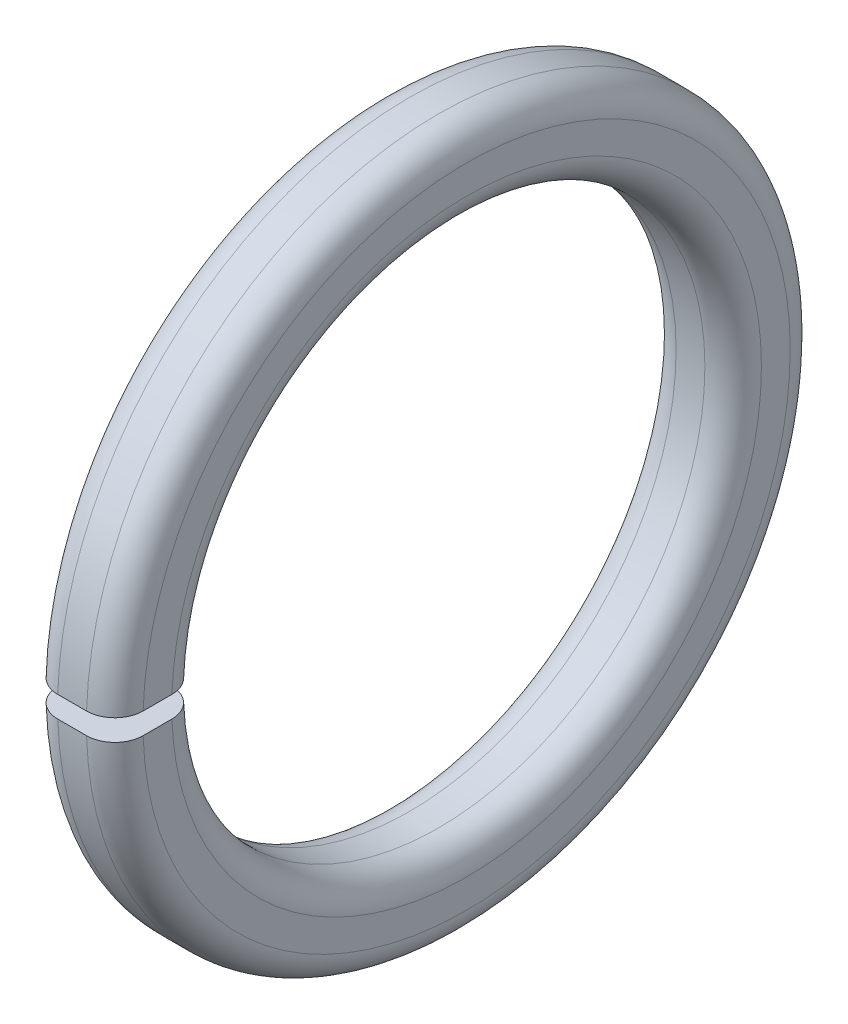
ISO-10303-21;
HEADER;
FILE_DESCRIPTION(('STEP AP214'),'2;1');
FILE_NAME('part.step','',(''),(''),'','','');
FILE_SCHEMA(('AUTOMOTIVE_DESIGN { 1 0 10303 214 1 1 1 1 }'));
ENDSEC;
DATA;
#1=APPLICATION_CONTEXT('core data for automotive mechanical design processes');
#2=APPLICATION_PROTOCOL_DEFINITION('international standard','automotive_design',2000,#1);
#3=PRODUCT_CONTEXT('',#1,'mechanical');
#4=PRODUCT('Part','Part','',(#3));
#5=PRODUCT_RELATED_PRODUCT_CATEGORY('part','',(#4));
#6=PRODUCT_DEFINITION_FORMATION('','',#4);
#7=PRODUCT_DEFINITION_CONTEXT('part definition',#1,'design');
#8=PRODUCT_DEFINITION('design','',#6,#7);
#9=PRODUCT_DEFINITION_SHAPE('','',#8);
#10=(LENGTH_UNIT() NAMED_UNIT(*) SI_UNIT(.MILLI.,.METRE.));
#11=(NAMED_UNIT(*) PLANE_ANGLE_UNIT() SI_UNIT($,.RADIAN.));
#12=(NAMED_UNIT(*) SI_UNIT($,.STERADIAN.) SOLID_ANGLE_UNIT());
#13=UNCERTAINTY_MEASURE_WITH_UNIT(LENGTH_MEASURE(1.E-05),#10,'distance_accuracy_value','');
#14=(GEOMETRIC_REPRESENTATION_CONTEXT(3) GLOBAL_UNCERTAINTY_ASSIGNED_CONTEXT((#13)) GLOBAL_UNIT_ASSIGNED_CONTEXT((#10,
#11,#12)) REPRESENTATION_CONTEXT('',''));
#15=CARTESIAN_POINT('',(0.,0.,0.));
#16=DIRECTION('',(0.,0.,1.));
#17=DIRECTION('',(1.,0.,0.));
#18=AXIS2_PLACEMENT_3D('',#15,#16,#17);
#19=CARTESIAN_POINT('',(-5.35,0.,0.));
#20=DIRECTION('',(-1.,0.,0.));
#21=DIRECTION('',(0.,0.,1.));
#22=AXIS2_PLACEMENT_3D('',#19,#20,#21);
#23=TOROIDAL_SURFACE('',#22,27.65,2.65);
#24=CARTESIAN_POINT('',(-5.35,0.,0.));
#25=DIRECTION('',(-1.,0.,0.));
#26=DIRECTION('',(0.,0.,1.));
#27=AXIS2_PLACEMENT_3D('',#24,#25,#26);
#28=CIRCLE('',#27,25.);
#29=CARTESIAN_POINT('',(-5.35,1.,24.9799919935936));
#30=VERTEX_POINT('',#29);
#31=CARTESIAN_POINT('',(-5.34999999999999,-1.,24.9799919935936));
#32=VERTEX_POINT('',#31);
#33=EDGE_CURVE('E129',#30,#32,#28,.T.);
#34=ORIENTED_EDGE('',*,*,#33,.F.);
#35=CARTESIAN_POINT('',(-6.96990723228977,1.,25.5331887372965));
#36=CARTESIAN_POINT('',(-7.08775296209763,1.,25.6242910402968));
#37=CARTESIAN_POINT('',(-7.19798718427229,1.,25.7254175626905));
#38=CARTESIAN_POINT('',(-7.39999939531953,1.,25.9448314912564));
#39=CARTESIAN_POINT('',(-7.49175482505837,1.,26.0631395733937));
#40=CARTESIAN_POINT('',(-7.65406230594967,1.,26.3134319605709));
#41=CARTESIAN_POINT('',(-7.72462504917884,1.,26.4454093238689));
#42=CARTESIAN_POINT('',(-7.84258219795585,1.,26.7192973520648));
#43=CARTESIAN_POINT('',(-7.88998236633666,1.,26.8612055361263));
#44=CARTESIAN_POINT('',(-7.96032408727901,1.,27.1510413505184));
#45=CARTESIAN_POINT('',(-7.98325249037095,1.,27.2989721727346));
#46=CARTESIAN_POINT('',(-8.00395499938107,1.,27.5965894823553));
#47=CARTESIAN_POINT('',(-8.00172806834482,1.,27.7462760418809));
#48=CARTESIAN_POINT('',(-7.97217620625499,1.,28.0431803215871));
#49=CARTESIAN_POINT('',(-7.94484643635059,1.,28.1903975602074));
#50=CARTESIAN_POINT('',(-7.8658537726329,1.,28.4781521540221));
#51=CARTESIAN_POINT('',(-7.81419094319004,1.,28.6186895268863));
#52=CARTESIAN_POINT('',(-7.68800789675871,1.,28.8890609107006));
#53=CARTESIAN_POINT('',(-7.61349268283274,1.,29.018897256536));
#54=CARTESIAN_POINT('',(-7.44371189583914,1.,29.2642084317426));
#55=CARTESIAN_POINT('',(-7.34844641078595,1.,29.3796833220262));
#56=CARTESIAN_POINT('',(-7.13992009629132,1.,29.5929308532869));
#57=CARTESIAN_POINT('',(-7.02666838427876,1.,29.6907124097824));
#58=CARTESIAN_POINT('',(-6.7853482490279,1.,29.8658615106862));
#59=CARTESIAN_POINT('',(-6.65727985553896,1.,29.9432290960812));
#60=CARTESIAN_POINT('',(-6.39003987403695,1.,30.0753083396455));
#61=CARTESIAN_POINT('',(-6.25087460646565,1.,30.1300327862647));
#62=CARTESIAN_POINT('',(-5.96532964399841,1.,30.2153300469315));
#63=CARTESIAN_POINT('',(-5.81894997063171,1.,30.2459029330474));
#64=CARTESIAN_POINT('',(-5.52319669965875,1.,30.2820184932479));
#65=CARTESIAN_POINT('',(-5.3738243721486,1.,30.2875715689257));
#66=CARTESIAN_POINT('',(-5.07626814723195,1.,30.2735177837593));
#67=CARTESIAN_POINT('',(-4.92808424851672,1.,30.2539109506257));
#68=CARTESIAN_POINT('',(-4.63713119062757,1.,30.1900999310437));
#69=CARTESIAN_POINT('',(-4.49436132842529,1.,30.1458989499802));
#70=CARTESIAN_POINT('',(-4.2182666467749,1.,30.0341598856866));
#71=CARTESIAN_POINT('',(-4.08494183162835,1.,29.9666217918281));
#72=CARTESIAN_POINT('',(-3.83149247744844,1.,29.8101139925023));
#73=CARTESIAN_POINT('',(-3.71137052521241,1.,29.7211400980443));
#74=CARTESIAN_POINT('',(-3.48776039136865,1.,29.5242969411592));
#75=CARTESIAN_POINT('',(-3.38427224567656,1.,29.4164276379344));
#76=CARTESIAN_POINT('',(-3.19681541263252,1.,29.1848035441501));
#77=CARTESIAN_POINT('',(-3.1128557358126,1.,29.0610414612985));
#78=CARTESIAN_POINT('',(-2.96689212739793,1.,28.801184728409));
#79=CARTESIAN_POINT('',(-2.90488826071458,1.,28.6650900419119));
#80=CARTESIAN_POINT('',(-2.80455922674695,1.,28.3843481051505));
#81=CARTESIAN_POINT('',(-2.7662476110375,1.,28.2396960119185));
#82=CARTESIAN_POINT('',(-2.71444060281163,1.,27.9460140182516));
#83=CARTESIAN_POINT('',(-2.700945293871,1.,27.7969841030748));
#84=CARTESIAN_POINT('',(-2.69915037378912,1.,27.4987030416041));
#85=CARTESIAN_POINT('',(-2.71086249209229,1.,27.3494518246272));
#86=CARTESIAN_POINT('',(-2.75917372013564,1.,27.0550330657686));
#87=CARTESIAN_POINT('',(-2.79577284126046,1.,26.909865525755));
#88=CARTESIAN_POINT('',(-2.89282880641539,1.,26.62771475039));
#89=CARTESIAN_POINT('',(-2.95328898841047,1.,26.4907326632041));
#90=CARTESIAN_POINT('',(-3.09635528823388,1.,26.2288669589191));
#91=CARTESIAN_POINT('',(-3.17896142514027,1.,26.1039833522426));
#92=CARTESIAN_POINT('',(-3.3639508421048,1.,25.869903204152));
#93=CARTESIAN_POINT('',(-3.46632809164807,1.,25.7607018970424));
#94=CARTESIAN_POINT('',(-3.68797384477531,1.,25.5610505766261));
#95=CARTESIAN_POINT('',(-3.80724232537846,1.,25.4706005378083));
#96=CARTESIAN_POINT('',(-4.0592032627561,1.,25.3110830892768));
#97=CARTESIAN_POINT('',(-4.1918870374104,1.,25.2420019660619));
#98=CARTESIAN_POINT('',(-4.46697000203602,1.,25.1271172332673));
#99=CARTESIAN_POINT('',(-4.60936876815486,1.,25.0813126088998));
#100=CARTESIAN_POINT('',(-4.89971814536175,1.,25.0143119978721));
#101=CARTESIAN_POINT('',(-5.04766409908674,1.,24.9930958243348));
#102=CARTESIAN_POINT('',(-5.34505817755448,1.,24.9758103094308));
#103=CARTESIAN_POINT('',(-5.49450666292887,1.,24.9797471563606));
#104=CARTESIAN_POINT('',(-5.79061945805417,1.,25.0126610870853));
#105=CARTESIAN_POINT('',(-5.93728351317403,1.,25.0416404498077));
#106=CARTESIAN_POINT('',(-6.22353576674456,1.,25.1238034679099));
#107=CARTESIAN_POINT('',(-6.36313227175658,1.,25.176957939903));
#108=CARTESIAN_POINT('',(-6.58082324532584,1.,25.2815707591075));
#109=CARTESIAN_POINT('',(-6.66229940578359,1.,25.3261455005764));
#110=CARTESIAN_POINT('',(-6.82013727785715,1.,25.4235798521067));
#111=CARTESIAN_POINT('',(-6.89649899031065,1.,25.476439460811));
#112=CARTESIAN_POINT('',(-6.96990723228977,1.,25.5331887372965));
#113=B_SPLINE_CURVE_WITH_KNOTS('',3,(#35,#36,#37,#38,#39,#40,#41,#42,#43,#44,#45,#46,#47,#48,
#49,#50,#51,#52,#53,#54,#55,#56,#57,#58,#59,#60,#61,#62,#63,#64,#65,#66,#67,#68,#69,#70,#71,#72,
#73,#74,#75,#76,#77,#78,#79,#80,#81,#82,#83,#84,#85,#86,#87,#88,#89,#90,#91,#92,#93,#94,#95,#96,
#97,#98,#99,#100,#101,#102,#103,#104,#105,#106,#107,#108,#109,#110,#111,#112),.UNSPECIFIED.,.T.,
.F.,(4,2,2,2,2,2,2,2,2,2,2,2,2,2,2,2,2,2,2,2,2,2,2,2,2,2,2,2,2,2,2,2,2,2,2,2,2,2,4),(0.,
0.446522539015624,0.893586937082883,1.34042540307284,1.78715263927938,2.23411979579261,
2.68110537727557,3.12817713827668,3.57524771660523,4.02222048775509,4.46919136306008,
4.91593638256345,5.36268050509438,5.80917196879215,6.25566210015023,6.70196659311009,
7.14827059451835,7.59451644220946,8.04076249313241,8.48709582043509,8.93343011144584,
9.37996993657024,9.82651108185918,10.2733074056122,10.7201052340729,11.1671110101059,
11.6141169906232,12.0611855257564,12.5082544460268,12.9551872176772,13.4021193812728,
13.8487641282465,14.2953894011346,14.7416477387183,15.1880158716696,15.6344246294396,
16.0802959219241,16.3584429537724,16.6365899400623),.UNSPECIFIED.);
#114=CARTESIAN_POINT('',(-8.,1.,27.6319109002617));
#115=VERTEX_POINT('',#114);
#116=EDGE_CURVE('E53',#30,#115,#113,.T.);
#117=ORIENTED_EDGE('',*,*,#116,.T.);
#118=CARTESIAN_POINT('',(-8.,0.,0.));
#119=DIRECTION('',(-1.,0.,0.));
#120=DIRECTION('',(0.,0.,1.));
#121=AXIS2_PLACEMENT_3D('',#118,#119,#120);
#122=CIRCLE('',#121,27.65);
#123=CARTESIAN_POINT('',(-8.,-1.,27.6319109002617));
#124=VERTEX_POINT('',#123);
#125=EDGE_CURVE('E141',#115,#124,#122,.T.);
#126=ORIENTED_EDGE('',*,*,#125,.T.);
#127=CARTESIAN_POINT('',(-6.96990723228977,-1.,25.5331887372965));
#128=CARTESIAN_POINT('',(-6.85217775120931,-1.,25.4421929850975));
#129=CARTESIAN_POINT('',(-6.72668223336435,-1.,25.3610683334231));
#130=CARTESIAN_POINT('',(-6.46374833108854,-1.,25.220972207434));
#131=CARTESIAN_POINT('',(-6.32629585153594,-1.,25.1620273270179));
#132=CARTESIAN_POINT('',(-6.04349278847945,-1.,25.0680816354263));
#133=CARTESIAN_POINT('',(-5.89814580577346,-1.,25.0330700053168));
#134=CARTESIAN_POINT('',(-5.60367564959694,-1.,24.9879664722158));
#135=CARTESIAN_POINT('',(-5.45455342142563,-1.,24.9778683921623));
#136=CARTESIAN_POINT('',(-5.15676828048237,-1.,24.982858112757));
#137=CARTESIAN_POINT('',(-5.00810526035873,-1.,24.9979394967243));
#138=CARTESIAN_POINT('',(-4.7154159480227,-1.,25.0528474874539));
#139=CARTESIAN_POINT('',(-4.57138983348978,-1.,25.0926750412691));
#140=CARTESIAN_POINT('',(-4.29206798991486,-1.,25.1959394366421));
#141=CARTESIAN_POINT('',(-4.15677216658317,-1.,25.2593760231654));
#142=CARTESIAN_POINT('',(-3.8987435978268,-1.,25.4080514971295));
#143=CARTESIAN_POINT('',(-3.77601085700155,-1.,25.4932903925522));
#144=CARTESIAN_POINT('',(-3.54652145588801,-1.,25.6831964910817));
#145=CARTESIAN_POINT('',(-3.43977321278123,-1.,25.7878738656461));
#146=CARTESIAN_POINT('',(-3.24534991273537,-1.,26.0136524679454));
#147=CARTESIAN_POINT('',(-3.15767489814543,-1.,26.1347537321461));
#148=CARTESIAN_POINT('',(-3.00381829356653,-1.,26.3900390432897));
#149=CARTESIAN_POINT('',(-2.93765268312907,-1.,26.5242327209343));
#150=CARTESIAN_POINT('',(-2.8287747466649,-1.,26.8018193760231));
#151=CARTESIAN_POINT('',(-2.7860625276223,-1.,26.9452123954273));
#152=CARTESIAN_POINT('',(-2.72528173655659,-1.,27.2372159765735));
#153=CARTESIAN_POINT('',(-2.70722736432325,-1.,27.3858294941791));
#154=CARTESIAN_POINT('',(-2.69632023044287,-1.,27.6839785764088));
#155=CARTESIAN_POINT('',(-2.70346749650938,-1.,27.8335141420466));
#156=CARTESIAN_POINT('',(-2.7427665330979,-1.,28.1292884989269));
#157=CARTESIAN_POINT('',(-2.77492249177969,-1.,28.2755267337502));
#158=CARTESIAN_POINT('',(-2.86333556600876,-1.,28.5605267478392));
#159=CARTESIAN_POINT('',(-2.91959266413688,-1.,28.6992885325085));
#160=CARTESIAN_POINT('',(-3.05459827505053,-1.,28.9653569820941));
#161=CARTESIAN_POINT('',(-3.13334100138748,-1.,29.092666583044));
#162=CARTESIAN_POINT('',(-3.31109278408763,-1.,29.3322499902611));
#163=CARTESIAN_POINT('',(-3.41010178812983,-1.,29.4445238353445));
#164=CARTESIAN_POINT('',(-3.62552082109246,-1.,29.6507855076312));
#165=CARTESIAN_POINT('',(-3.74192174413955,-1.,29.7447828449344));
#166=CARTESIAN_POINT('',(-3.98885965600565,-1.,29.911888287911));
#167=CARTESIAN_POINT('',(-4.11939660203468,-1.,29.9849964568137));
#168=CARTESIAN_POINT('',(-4.39082246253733,-1.,30.1082059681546));
#169=CARTESIAN_POINT('',(-4.53170554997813,-1.,30.1583201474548));
#170=CARTESIAN_POINT('',(-4.81988733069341,-1.,30.2341744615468));
#171=CARTESIAN_POINT('',(-4.96718600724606,-1.,30.2599146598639));
#172=CARTESIAN_POINT('',(-5.26395564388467,-1.,30.286282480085));
#173=CARTESIAN_POINT('',(-5.41342572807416,-1.,30.2869199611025));
#174=CARTESIAN_POINT('',(-5.7103508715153,-1.,30.2630891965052));
#175=CARTESIAN_POINT('',(-5.85780593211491,-1.,30.2386209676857));
#176=CARTESIAN_POINT('',(-6.14650060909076,-1.,30.1652791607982));
#177=CARTESIAN_POINT('',(-6.28774083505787,-1.,30.1164079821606));
#178=CARTESIAN_POINT('',(-6.56001428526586,-1.,29.9956523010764));
#179=CARTESIAN_POINT('',(-6.69104751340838,-1.,29.9237678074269));
#180=CARTESIAN_POINT('',(-6.93922065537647,-1.,29.759011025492));
#181=CARTESIAN_POINT('',(-7.05635743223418,-1.,29.6661340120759));
#182=CARTESIAN_POINT('',(-7.27338517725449,-1.,29.4620410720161));
#183=CARTESIAN_POINT('',(-7.37327607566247,-1.,29.3508250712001));
#184=CARTESIAN_POINT('',(-7.55302818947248,-1.,29.1131553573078));
#185=CARTESIAN_POINT('',(-7.63287981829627,-1.,28.986694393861));
#186=CARTESIAN_POINT('',(-7.77023291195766,-1.,28.7221671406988));
#187=CARTESIAN_POINT('',(-7.82773426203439,-1.,28.5841007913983));
#188=CARTESIAN_POINT('',(-7.91878934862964,-1.,28.3001951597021));
#189=CARTESIAN_POINT('',(-7.9523289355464,-1.,28.1543513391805));
#190=CARTESIAN_POINT('',(-7.99445742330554,-1.,27.8591091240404));
#191=CARTESIAN_POINT('',(-8.00304723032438,-1.,27.7097108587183));
#192=CARTESIAN_POINT('',(-7.99503738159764,-1.,27.4115412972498));
#193=CARTESIAN_POINT('',(-7.97842921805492,-1.,27.2627702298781));
#194=CARTESIAN_POINT('',(-7.92046763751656,-1.,26.9700869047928));
#195=CARTESIAN_POINT('',(-7.87910804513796,-1.,26.8261758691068));
#196=CARTESIAN_POINT('',(-7.77279275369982,-1.,26.5472708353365));
#197=CARTESIAN_POINT('',(-7.70782345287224,-1.,26.4122820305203));
#198=CARTESIAN_POINT('',(-7.5561727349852,-1.,26.1552580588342));
#199=CARTESIAN_POINT('',(-7.46951753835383,-1.,26.0332075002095));
#200=CARTESIAN_POINT('',(-7.31310425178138,-1.,25.8481270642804));
#201=CARTESIAN_POINT('',(-7.24915594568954,-1.,25.7801010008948));
#202=CARTESIAN_POINT('',(-7.11445810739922,-1.,25.6511531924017));
#203=CARTESIAN_POINT('',(-7.04370857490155,-1.,25.5902314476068));
#204=CARTESIAN_POINT('',(-6.96990723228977,-1.,25.5331887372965));
#205=B_SPLINE_CURVE_WITH_KNOTS('',3,(#127,#128,#129,#130,#131,#132,#133,#134,#135,#136,#137,
#138,#139,#140,#141,#142,#143,#144,#145,#146,#147,#148,#149,#150,#151,#152,#153,#154,#155,#156,
#157,#158,#159,#160,#161,#162,#163,#164,#165,#166,#167,#168,#169,#170,#171,#172,#173,#174,#175,
#176,#177,#178,#179,#180,#181,#182,#183,#184,#185,#186,#187,#188,#189,#190,#191,#192,#193,#194,
#195,#196,#197,#198,#199,#200,#201,#202,#203,#204),.UNSPECIFIED.,.T.,.F.,(4,2,2,2,2,2,2,2,2,2,2,
2,2,2,2,2,2,2,2,2,2,2,2,2,2,2,2,2,2,2,2,2,2,2,2,2,2,2,4),(0.,0.446049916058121,
0.892632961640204,1.33901399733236,1.78528434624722,2.23144098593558,2.67761470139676,
3.1237835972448,3.56995265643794,4.01635584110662,4.4627600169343,4.90949507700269,
5.35623217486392,5.80322642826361,6.25022117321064,6.6972907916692,7.14436008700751,
7.59131443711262,8.03826763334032,8.48498763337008,8.93170628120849,9.37817523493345,
9.8246430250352,10.270935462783,10.717227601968,11.1634758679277,11.6097239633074,
12.0560726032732,12.5024230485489,12.9489866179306,13.39555248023,13.8423818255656,
14.2891949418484,14.7361589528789,15.1832345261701,15.6305680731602,16.0773633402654,
16.3569796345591,16.6365959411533),.UNSPECIFIED.);
#206=EDGE_CURVE('E120',#124,#32,#205,.T.);
#207=ORIENTED_EDGE('',*,*,#206,.T.);
#208=EDGE_LOOP('',(#34,#117,#126,#207));
#209=FACE_BOUND('',#208,.T.);
#210=ADVANCED_FACE('F39',(#209),#23,.T.);
#211=CARTESIAN_POINT('',(-8.,30.35,0.));
#212=DIRECTION('',(1.,0.,0.));
#213=DIRECTION('',(0.,0.,-1.));
#214=AXIS2_PLACEMENT_3D('',#211,#212,#213);
#215=PLANE('',#214);
#216=DIRECTION('',(0.,0.,-1.));
#217=VECTOR('',#216,1.);
#218=CARTESIAN_POINT('',(-8.,1.,33.66));
#219=LINE('',#218,#217);
#220=CARTESIAN_POINT('',(-8.,1.,30.3335210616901));
#221=VERTEX_POINT('',#220);
#222=EDGE_CURVE('E109',#221,#115,#219,.T.);
#223=ORIENTED_EDGE('',*,*,#222,.F.);
#224=CARTESIAN_POINT('',(-8.,0.,0.));
#225=DIRECTION('',(-1.,0.,0.));
#226=DIRECTION('',(0.,0.,1.));
#227=AXIS2_PLACEMENT_3D('',#224,#225,#226);
#228=CIRCLE('',#227,30.35);
#229=CARTESIAN_POINT('',(-8.,-1.,30.3335210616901));
#230=VERTEX_POINT('',#229);
#231=EDGE_CURVE('E138',#221,#230,#228,.T.);
#232=ORIENTED_EDGE('',*,*,#231,.T.);
#233=DIRECTION('',(0.,0.,1.));
#234=VECTOR('',#233,1.);
#235=CARTESIAN_POINT('',(-8.,-1.,0.));
#236=LINE('',#235,#234);
#237=EDGE_CURVE('E121',#124,#230,#236,.T.);
#238=ORIENTED_EDGE('',*,*,#237,.F.);
#239=ORIENTED_EDGE('',*,*,#125,.F.);
#240=EDGE_LOOP('',(#223,#232,#238,#239));
#241=FACE_BOUND('',#240,.T.);
#242=ADVANCED_FACE('F214',(#241),#215,.F.);
#243=CARTESIAN_POINT('',(-5.35,0.,0.));
#244=DIRECTION('',(-1.,0.,0.));
#245=DIRECTION('',(0.,0.,1.));
#246=AXIS2_PLACEMENT_3D('',#243,#244,#245);
#247=TOROIDAL_SURFACE('',#246,30.35,2.65);
#248=CARTESIAN_POINT('',(-5.7802442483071,1.,27.7171261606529));
#249=CARTESIAN_POINT('',(-5.63345465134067,1.,27.6929644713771));
#250=CARTESIAN_POINT('',(-5.48451768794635,1.,27.6811817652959));
#251=CARTESIAN_POINT('',(-5.18665609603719,1.,27.6827838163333));
#252=CARTESIAN_POINT('',(-5.03773169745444,1.,27.696198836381));
#253=CARTESIAN_POINT('',(-4.74430892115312,1.,27.7478410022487));
#254=CARTESIAN_POINT('',(-4.59980843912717,1.,27.7860561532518));
#255=CARTESIAN_POINT('',(-4.31931281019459,1.,27.8861904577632));
#256=CARTESIAN_POINT('',(-4.183315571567,1.,27.9481037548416));
#257=CARTESIAN_POINT('',(-3.92360109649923,1.,28.0938917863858));
#258=CARTESIAN_POINT('',(-3.79988725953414,1.,28.1777725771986));
#259=CARTESIAN_POINT('',(-3.56828342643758,1.,28.3651061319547));
#260=CARTESIAN_POINT('',(-3.4603940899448,1.,28.4685597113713));
#261=CARTESIAN_POINT('',(-3.26344556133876,1.,28.6921575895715));
#262=CARTESIAN_POINT('',(-3.17439634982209,1.,28.8123106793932));
#263=CARTESIAN_POINT('',(-3.01772010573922,1.,29.0658542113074));
#264=CARTESIAN_POINT('',(-2.95009310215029,1.,29.1992446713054));
#265=CARTESIAN_POINT('',(-2.83814074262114,1.,29.4755604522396));
#266=CARTESIAN_POINT('',(-2.79382900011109,1.,29.6184912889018));
#267=CARTESIAN_POINT('',(-2.7298213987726,1.,29.9097621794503));
#268=CARTESIAN_POINT('',(-2.71012555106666,1.,30.0581022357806));
#269=CARTESIAN_POINT('',(-2.69590536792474,1.,30.3560345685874));
#270=CARTESIAN_POINT('',(-2.70138955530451,1.,30.5056272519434));
#271=CARTESIAN_POINT('',(-2.73739506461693,1.,30.8017688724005));
#272=CARTESIAN_POINT('',(-2.76791642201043,1.,30.9483178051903));
#273=CARTESIAN_POINT('',(-2.85313226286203,1.,31.2342064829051));
#274=CARTESIAN_POINT('',(-2.9078261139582,1.,31.3735464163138));
#275=CARTESIAN_POINT('',(-3.03983827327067,1.,31.6410617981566));
#276=CARTESIAN_POINT('',(-3.11715653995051,1.,31.7692372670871));
#277=CARTESIAN_POINT('',(-3.29219655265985,1.,32.0107385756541));
#278=CARTESIAN_POINT('',(-3.38991149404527,1.,32.1240693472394));
#279=CARTESIAN_POINT('',(-3.60298922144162,1.,32.3327077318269));
#280=CARTESIAN_POINT('',(-3.71835196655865,1.,32.4280153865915));
#281=CARTESIAN_POINT('',(-3.96339193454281,1.,32.5978540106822));
#282=CARTESIAN_POINT('',(-4.09306234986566,1.,32.6723948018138));
#283=CARTESIAN_POINT('',(-4.36308099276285,1.,32.7986378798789));
#284=CARTESIAN_POINT('',(-4.50342919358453,1.,32.8503402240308));
#285=CARTESIAN_POINT('',(-4.79075533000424,1.,32.929417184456));
#286=CARTESIAN_POINT('',(-4.93773042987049,1.,32.9568021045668));
#287=CARTESIAN_POINT('',(-5.2341921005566,1.,32.9865020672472));
#288=CARTESIAN_POINT('',(-5.38367866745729,1.,32.9888171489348));
#289=CARTESIAN_POINT('',(-5.6808841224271,1.,32.9683139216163));
#290=CARTESIAN_POINT('',(-5.82860340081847,1.,32.9455012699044));
#291=CARTESIAN_POINT('',(-6.11811555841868,1.,32.8754008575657));
#292=CARTESIAN_POINT('',(-6.25990843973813,1.,32.8281131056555));
#293=CARTESIAN_POINT('',(-6.533550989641,1.,32.7104049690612));
#294=CARTESIAN_POINT('',(-6.66540019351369,1.,32.639983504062));
#295=CARTESIAN_POINT('',(-6.91540922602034,1.,32.4780108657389));
#296=CARTESIAN_POINT('',(-7.03356903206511,1.,32.3864596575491));
#297=CARTESIAN_POINT('',(-7.25288465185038,1.,32.1847979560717));
#298=CARTESIAN_POINT('',(-7.35403528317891,1.,32.0746818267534));
#299=CARTESIAN_POINT('',(-7.53642401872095,1.,31.8390376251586));
#300=CARTESIAN_POINT('',(-7.61766209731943,1.,31.7135095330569));
#301=CARTESIAN_POINT('',(-7.75795980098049,1.,31.45054310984));
#302=CARTESIAN_POINT('',(-7.81700921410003,1.,31.3130993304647));
#303=CARTESIAN_POINT('',(-7.91120690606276,1.,31.0302516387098));
#304=CARTESIAN_POINT('',(-7.94635507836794,1.,30.8848476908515));
#305=CARTESIAN_POINT('',(-7.99176736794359,1.,30.5901378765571));
#306=CARTESIAN_POINT('',(-8.00202036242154,1.,30.4408302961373));
#307=CARTESIAN_POINT('',(-7.99732097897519,1.,30.142611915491));
#308=CARTESIAN_POINT('',(-7.98236850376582,1.,29.9937011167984));
#309=CARTESIAN_POINT('',(-7.92767486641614,1.,29.7004626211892));
#310=CARTESIAN_POINT('',(-7.88792714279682,1.,29.556136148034));
#311=CARTESIAN_POINT('',(-7.78476461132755,1.,29.2762112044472));
#312=CARTESIAN_POINT('',(-7.72135072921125,1.,29.1406123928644));
#313=CARTESIAN_POINT('',(-7.57266837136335,1.,28.8820156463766));
#314=CARTESIAN_POINT('',(-7.48740430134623,1.,28.759015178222));
#315=CARTESIAN_POINT('',(-7.29740243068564,1.,28.5290508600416));
#316=CARTESIAN_POINT('',(-7.19265983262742,1.,28.4220909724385));
#317=CARTESIAN_POINT('',(-6.9667016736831,1.,28.2272922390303));
#318=CARTESIAN_POINT('',(-6.84548552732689,1.,28.1394540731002));
#319=CARTESIAN_POINT('',(-6.59011080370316,1.,27.9854827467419));
#320=CARTESIAN_POINT('',(-6.45596802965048,1.,27.9193235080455));
#321=CARTESIAN_POINT('',(-6.23071607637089,1.,27.8309371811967));
#322=CARTESIAN_POINT('',(-6.14234888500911,1.,27.8015407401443));
#323=CARTESIAN_POINT('',(-5.96301586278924,1.,27.7521908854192));
#324=CARTESIAN_POINT('',(-5.87205003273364,1.,27.7322374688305));
#325=CARTESIAN_POINT('',(-5.7802442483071,1.,27.7171261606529));
#326=B_SPLINE_CURVE_WITH_KNOTS('',3,(#248,#249,#250,#251,#252,#253,#254,#255,#256,#257,#258,
#259,#260,#261,#262,#263,#264,#265,#266,#267,#268,#269,#270,#271,#272,#273,#274,#275,#276,#277,
#278,#279,#280,#281,#282,#283,#284,#285,#286,#287,#288,#289,#290,#291,#292,#293,#294,#295,#296,
#297,#298,#299,#300,#301,#302,#303,#304,#305,#306,#307,#308,#309,#310,#311,#312,#313,#314,#315,
#316,#317,#318,#319,#320,#321,#322,#323,#324,#325),.UNSPECIFIED.,.T.,.F.,(4,2,2,2,2,2,2,2,2,2,2,
2,2,2,2,2,2,2,2,2,2,2,2,2,2,2,2,2,2,2,2,2,2,2,2,2,2,2,4),(0.,0.445954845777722,
0.892445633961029,1.33872063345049,1.78488541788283,2.23117333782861,2.677479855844,
3.1240222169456,3.57056518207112,4.01736858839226,4.46417219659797,4.91112704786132,
5.35808253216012,5.80502632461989,6.25196929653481,6.69876339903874,7.14555646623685,
7.59213785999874,8.03871813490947,8.48510909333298,8.93149935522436,9.37778913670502,
9.82407875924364,10.2703892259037,10.71670042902,11.1631473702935,11.6095948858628,
12.0562476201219,12.5029023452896,12.9497565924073,13.3966125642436,13.8435868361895,
14.2905436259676,14.7374103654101,15.184387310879,15.63138014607,16.0778332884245,
16.3567443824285,16.6356553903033),.UNSPECIFIED.);
#327=CARTESIAN_POINT('',(-5.35,1.,32.9848450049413));
#328=VERTEX_POINT('',#327);
#329=EDGE_CURVE('E152',#328,#221,#326,.T.);
#330=ORIENTED_EDGE('',*,*,#329,.F.);
#331=CARTESIAN_POINT('',(-5.35,0.,0.));
#332=DIRECTION('',(-1.,0.,0.));
#333=DIRECTION('',(0.,0.,1.));
#334=AXIS2_PLACEMENT_3D('',#331,#332,#333);
#335=CIRCLE('',#334,33.);
#336=CARTESIAN_POINT('',(-5.35,-1.,32.9848450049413));
#337=VERTEX_POINT('',#336);
#338=EDGE_CURVE('E135',#328,#337,#335,.T.);
#339=ORIENTED_EDGE('',*,*,#338,.T.);
#340=CARTESIAN_POINT('',(-5.7802442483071,-1.,27.7171261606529));
#341=CARTESIAN_POINT('',(-5.9270773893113,-1.,27.7413084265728));
#342=CARTESIAN_POINT('',(-6.07197486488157,-1.,27.7779124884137));
#343=CARTESIAN_POINT('',(-6.35368560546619,-1.,27.8749649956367));
#344=CARTESIAN_POINT('',(-6.49048889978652,-1.,27.9354421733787));
#345=CARTESIAN_POINT('',(-6.7519428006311,-1.,28.0784830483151));
#346=CARTESIAN_POINT('',(-6.87659943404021,-1.,28.1610357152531));
#347=CARTESIAN_POINT('',(-7.11025577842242,-1.,28.3458678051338));
#348=CARTESIAN_POINT('',(-7.21925935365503,-1.,28.4481423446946));
#349=CARTESIAN_POINT('',(-7.41861742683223,-1.,28.6695826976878));
#350=CARTESIAN_POINT('',(-7.50896250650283,-1.,28.7887569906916));
#351=CARTESIAN_POINT('',(-7.66837989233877,-1.,29.0405790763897));
#352=CARTESIAN_POINT('',(-7.73745129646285,-1.,29.1732274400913));
#353=CARTESIAN_POINT('',(-7.85239618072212,-1.,29.4483092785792));
#354=CARTESIAN_POINT('',(-7.89825649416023,-1.,29.5907482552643));
#355=CARTESIAN_POINT('',(-7.96542207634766,-1.,29.8813022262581));
#356=CARTESIAN_POINT('',(-7.98672733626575,-1.,30.0294172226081));
#357=CARTESIAN_POINT('',(-8.00418239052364,-1.,30.3271745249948));
#358=CARTESIAN_POINT('',(-8.00032335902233,-1.,30.4768173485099));
#359=CARTESIAN_POINT('',(-7.96753699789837,-1.,30.7733310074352));
#360=CARTESIAN_POINT('',(-7.93860970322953,-1.,30.9202018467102));
#361=CARTESIAN_POINT('',(-7.85650518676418,-1.,31.2069993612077));
#362=CARTESIAN_POINT('',(-7.80332829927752,-1.,31.3469261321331));
#363=CARTESIAN_POINT('',(-7.67423006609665,-1.,31.6158619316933));
#364=CARTESIAN_POINT('',(-7.59830872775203,-1.,31.7448709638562));
#365=CARTESIAN_POINT('',(-7.42590180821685,-1.,31.9882629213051));
#366=CARTESIAN_POINT('',(-7.32942293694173,-1.,32.1026505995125));
#367=CARTESIAN_POINT('',(-7.11862233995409,-1.,32.3135953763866));
#368=CARTESIAN_POINT('',(-7.00430066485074,-1.,32.4101525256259));
#369=CARTESIAN_POINT('',(-6.76111747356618,-1.,32.5826468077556));
#370=CARTESIAN_POINT('',(-6.63226284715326,-1.,32.6585936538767));
#371=CARTESIAN_POINT('',(-6.36362796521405,-1.,32.7877657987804));
#372=CARTESIAN_POINT('',(-6.22384773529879,-1.,32.8409911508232));
#373=CARTESIAN_POINT('',(-5.93739401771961,-1.,32.9231868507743));
#374=CARTESIAN_POINT('',(-5.79072350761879,-1.,32.952167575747));
#375=CARTESIAN_POINT('',(-5.49459871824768,-1.,32.9850874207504));
#376=CARTESIAN_POINT('',(-5.34514444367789,-1.,32.9890265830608));
#377=CARTESIAN_POINT('',(-5.04773165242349,-1.,32.9717532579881));
#378=CARTESIAN_POINT('',(-4.89977279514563,-1.,32.9505466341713));
#379=CARTESIAN_POINT('',(-4.60951530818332,-1.,32.8835950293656));
#380=CARTESIAN_POINT('',(-4.46721667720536,-1.,32.8378500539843));
#381=CARTESIAN_POINT('',(-4.19231218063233,-1.,32.7231209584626));
#382=CARTESIAN_POINT('',(-4.05970668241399,-1.,32.6541359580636));
#383=CARTESIAN_POINT('',(-3.80795489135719,-1.,32.4948888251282));
#384=CARTESIAN_POINT('',(-3.68880861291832,-1.,32.4046266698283));
#385=CARTESIAN_POINT('',(-3.46731842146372,-1.,32.2053602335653));
#386=CARTESIAN_POINT('',(-3.36497950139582,-1.,32.0963504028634));
#387=CARTESIAN_POINT('',(-3.18004531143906,-1.,31.8627035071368));
#388=CARTESIAN_POINT('',(-3.09745009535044,-1.,31.7380663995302));
#389=CARTESIAN_POINT('',(-2.95430742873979,-1.,31.4766422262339));
#390=CARTESIAN_POINT('',(-2.89377008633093,-1.,31.3398496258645));
#391=CARTESIAN_POINT('',(-2.79650845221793,-1.,31.0580457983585));
#392=CARTESIAN_POINT('',(-2.75978419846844,-1.,30.9130345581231));
#393=CARTESIAN_POINT('',(-2.71117514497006,-1.,30.6188395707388));
#394=CARTESIAN_POINT('',(-2.69930157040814,-1.,30.4696539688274));
#395=CARTESIAN_POINT('',(-2.70076204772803,-1.,30.1714058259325));
#396=CARTESIAN_POINT('',(-2.71409619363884,-1.,30.0223432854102));
#397=CARTESIAN_POINT('',(-2.76560056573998,-1.,29.7285333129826));
#398=CARTESIAN_POINT('',(-2.8037770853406,-1.,29.5837869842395));
#399=CARTESIAN_POINT('',(-2.90389109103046,-1.,29.3027584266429));
#400=CARTESIAN_POINT('',(-2.96582862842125,-1.,29.1664762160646));
#401=CARTESIAN_POINT('',(-3.11170529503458,-1.,28.9062567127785));
#402=CARTESIAN_POINT('',(-3.19564296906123,-1.,28.7823186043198));
#403=CARTESIAN_POINT('',(-3.38313972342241,-1.,28.5503061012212));
#404=CARTESIAN_POINT('',(-3.4866979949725,-1.,28.4422310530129));
#405=CARTESIAN_POINT('',(-3.71043879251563,-1.,28.2450686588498));
#406=CARTESIAN_POINT('',(-3.83061234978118,-1.,28.155971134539));
#407=CARTESIAN_POINT('',(-4.08425371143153,-1.,27.9992085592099));
#408=CARTESIAN_POINT('',(-4.21772477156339,-1.,27.9315487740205));
#409=CARTESIAN_POINT('',(-4.49410659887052,-1.,27.8196281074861));
#410=CARTESIAN_POINT('',(-4.63701616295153,-1.,27.7753642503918));
#411=CARTESIAN_POINT('',(-4.92812358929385,-1.,27.7115291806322));
#412=CARTESIAN_POINT('',(-5.07631485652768,-1.,27.6919282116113));
#413=CARTESIAN_POINT('',(-5.31778482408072,-1.,27.6805064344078));
#414=CARTESIAN_POINT('',(-5.41076711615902,-1.,27.6810130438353));
#415=CARTESIAN_POINT('',(-5.5961657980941,-1.,27.6917748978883));
#416=CARTESIAN_POINT('',(-5.68858218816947,-1.,27.7020301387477));
#417=CARTESIAN_POINT('',(-5.7802442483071,-1.,27.7171261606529));
#418=B_SPLINE_CURVE_WITH_KNOTS('',3,(#340,#341,#342,#343,#344,#345,#346,#347,#348,#349,#350,
#351,#352,#353,#354,#355,#356,#357,#358,#359,#360,#361,#362,#363,#364,#365,#366,#367,#368,#369,
#370,#371,#372,#373,#374,#375,#376,#377,#378,#379,#380,#381,#382,#383,#384,#385,#386,#387,#388,
#389,#390,#391,#392,#393,#394,#395,#396,#397,#398,#399,#400,#401,#402,#403,#404,#405,#406,#407,
#408,#409,#410,#411,#412,#413,#414,#415,#416,#417),.UNSPECIFIED.,.T.,.F.,(4,2,2,2,2,2,2,2,2,2,2,
2,2,2,2,2,2,2,2,2,2,2,2,2,2,2,2,2,2,2,2,2,2,2,2,2,2,2,4),(0.,0.446094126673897,
0.892726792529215,1.33913670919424,1.78543623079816,2.23196048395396,2.67850366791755,
3.1252998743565,3.57209624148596,4.0190493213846,4.46600177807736,4.91294807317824,
5.35989422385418,5.80669471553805,6.25349393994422,6.70008222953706,7.14666947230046,
7.59306547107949,8.03946071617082,8.48575189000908,8.93204296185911,9.37835093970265,
9.82465939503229,10.2711001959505,10.7175422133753,11.1641885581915,11.6108356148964,
12.0576843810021,12.5045348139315,12.9514984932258,13.3984631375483,13.8453982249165,
14.292314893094,14.7389912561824,15.1857772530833,15.6325064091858,16.0786960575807,
16.3571748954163,16.6356536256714),.UNSPECIFIED.);
#419=EDGE_CURVE('E206',#230,#337,#418,.T.);
#420=ORIENTED_EDGE('',*,*,#419,.F.);
#421=ORIENTED_EDGE('',*,*,#231,.F.);
#422=EDGE_LOOP('',(#330,#339,#420,#421));
#423=FACE_BOUND('',#422,.T.);
#424=ADVANCED_FACE('F162',(#423),#247,.T.);
#425=CARTESIAN_POINT('',(-34.9249999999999,0.,0.));
#426=DIRECTION('',(-1.,0.,0.));
#427=DIRECTION('',(0.,0.,1.));
#428=AXIS2_PLACEMENT_3D('',#425,#426,#427);
#429=CYLINDRICAL_SURFACE('',#428,33.);
#430=DIRECTION('',(-1.,0.,0.));
#431=VECTOR('',#430,1.);
#432=CARTESIAN_POINT('',(-34.9249999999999,1.,32.9848450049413));
#433=LINE('',#432,#431);
#434=CARTESIAN_POINT('',(-2.65,1.,32.9848450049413));
#435=VERTEX_POINT('',#434);
#436=EDGE_CURVE('E153',#435,#328,#433,.T.);
#437=ORIENTED_EDGE('',*,*,#436,.F.);
#438=CARTESIAN_POINT('',(-2.65,0.,0.));
#439=DIRECTION('',(-1.,0.,0.));
#440=DIRECTION('',(0.,0.,1.));
#441=AXIS2_PLACEMENT_3D('',#438,#439,#440);
#442=CIRCLE('',#441,33.);
#443=CARTESIAN_POINT('',(-2.64999999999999,-1.,32.9848450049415));
#444=VERTEX_POINT('',#443);
#445=EDGE_CURVE('E127',#435,#444,#442,.T.);
#446=ORIENTED_EDGE('',*,*,#445,.T.);
#447=DIRECTION('',(-1.,0.,0.));
#448=VECTOR('',#447,1.);
#449=CARTESIAN_POINT('',(-34.9249999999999,-1.,32.9848450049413));
#450=LINE('',#449,#448);
#451=EDGE_CURVE('E202',#337,#444,#450,.F.);
#452=ORIENTED_EDGE('',*,*,#451,.F.);
#453=ORIENTED_EDGE('',*,*,#338,.F.);
#454=EDGE_LOOP('',(#437,#446,#452,#453));
#455=FACE_BOUND('',#454,.T.);
#456=ADVANCED_FACE('F194',(#455),#429,.T.);
#457=CARTESIAN_POINT('',(-2.65,0.,0.));
#458=DIRECTION('',(-1.,0.,0.));
#459=DIRECTION('',(0.,0.,1.));
#460=AXIS2_PLACEMENT_3D('',#457,#458,#459);
#461=TOROIDAL_SURFACE('',#460,30.35,2.65);
#462=CARTESIAN_POINT('',(-2.2197557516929,1.,27.7171261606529));
#463=CARTESIAN_POINT('',(-2.0729226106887,1.,27.7413084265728));
#464=CARTESIAN_POINT('',(-1.92802513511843,1.,27.7779124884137));
#465=CARTESIAN_POINT('',(-1.64631439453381,1.,27.8749649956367));
#466=CARTESIAN_POINT('',(-1.50951110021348,1.,27.9354421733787));
#467=CARTESIAN_POINT('',(-1.2480571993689,1.,28.0784830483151));
#468=CARTESIAN_POINT('',(-1.12340056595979,1.,28.1610357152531));
#469=CARTESIAN_POINT('',(-0.889744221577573,1.,28.3458678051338));
#470=CARTESIAN_POINT('',(-0.780740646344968,1.,28.4481423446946));
#471=CARTESIAN_POINT('',(-0.581382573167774,1.,28.6695826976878));
#472=CARTESIAN_POINT('',(-0.491037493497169,1.,28.7887569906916));
#473=CARTESIAN_POINT('',(-0.331620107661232,1.,29.0405790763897));
#474=CARTESIAN_POINT('',(-0.262548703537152,1.,29.1732274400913));
#475=CARTESIAN_POINT('',(-0.147603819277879,1.,29.4483092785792));
#476=CARTESIAN_POINT('',(-0.10174350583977,1.,29.5907482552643));
#477=CARTESIAN_POINT('',(-0.0345779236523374,1.,29.8813022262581));
#478=CARTESIAN_POINT('',(-0.0132726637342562,1.,30.0294172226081));
#479=CARTESIAN_POINT('',(0.00418239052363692,1.,30.3271745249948));
#480=CARTESIAN_POINT('',(0.000323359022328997,1.,30.4768173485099));
#481=CARTESIAN_POINT('',(-0.0324630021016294,1.,30.7733310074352));
#482=CARTESIAN_POINT('',(-0.0613902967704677,1.,30.9202018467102));
#483=CARTESIAN_POINT('',(-0.143494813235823,1.,31.2069993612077));
#484=CARTESIAN_POINT('',(-0.196671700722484,1.,31.3469261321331));
#485=CARTESIAN_POINT('',(-0.32576993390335,1.,31.6158619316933));
#486=CARTESIAN_POINT('',(-0.401691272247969,1.,31.7448709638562));
#487=CARTESIAN_POINT('',(-0.574098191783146,1.,31.9882629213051));
#488=CARTESIAN_POINT('',(-0.670577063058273,1.,32.1026505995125));
#489=CARTESIAN_POINT('',(-0.88137766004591,1.,32.3135953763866));
#490=CARTESIAN_POINT('',(-0.995699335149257,1.,32.4101525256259));
#491=CARTESIAN_POINT('',(-1.23888252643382,1.,32.5826468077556));
#492=CARTESIAN_POINT('',(-1.36773715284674,1.,32.6585936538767));
#493=CARTESIAN_POINT('',(-1.63637203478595,1.,32.7877657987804));
#494=CARTESIAN_POINT('',(-1.77615226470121,1.,32.8409911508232));
#495=CARTESIAN_POINT('',(-2.06260598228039,1.,32.9231868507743));
#496=CARTESIAN_POINT('',(-2.20927649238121,1.,32.952167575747));
#497=CARTESIAN_POINT('',(-2.50540128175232,1.,32.9850874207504));
#498=CARTESIAN_POINT('',(-2.65485555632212,1.,32.9890265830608));
#499=CARTESIAN_POINT('',(-2.95226834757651,1.,32.9717532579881));
#500=CARTESIAN_POINT('',(-3.10022720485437,1.,32.9505466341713));
#501=CARTESIAN_POINT('',(-3.39048469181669,1.,32.8835950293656));
#502=CARTESIAN_POINT('',(-3.53278332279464,1.,32.8378500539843));
#503=CARTESIAN_POINT('',(-3.80768781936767,1.,32.7231209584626));
#504=CARTESIAN_POINT('',(-3.94029331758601,1.,32.6541359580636));
#505=CARTESIAN_POINT('',(-4.19204510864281,1.,32.4948888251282));
#506=CARTESIAN_POINT('',(-4.31119138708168,1.,32.4046266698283));
#507=CARTESIAN_POINT('',(-4.53268157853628,1.,32.2053602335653));
#508=CARTESIAN_POINT('',(-4.63502049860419,1.,32.0963504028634));
#509=CARTESIAN_POINT('',(-4.81995468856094,1.,31.8627035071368));
#510=CARTESIAN_POINT('',(-4.90254990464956,1.,31.7380663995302));
#511=CARTESIAN_POINT('',(-5.04569257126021,1.,31.4766422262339));
#512=CARTESIAN_POINT('',(-5.10622991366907,1.,31.3398496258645));
#513=CARTESIAN_POINT('',(-5.20349154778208,1.,31.0580457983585));
#514=CARTESIAN_POINT('',(-5.24021580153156,1.,30.9130345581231));
#515=CARTESIAN_POINT('',(-5.28882485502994,1.,30.6188395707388));
#516=CARTESIAN_POINT('',(-5.30069842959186,1.,30.4696539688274));
#517=CARTESIAN_POINT('',(-5.29923795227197,1.,30.1714058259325));
#518=CARTESIAN_POINT('',(-5.28590380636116,1.,30.0223432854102));
#519=CARTESIAN_POINT('',(-5.23439943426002,1.,29.7285333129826));
#520=CARTESIAN_POINT('',(-5.19622291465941,1.,29.5837869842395));
#521=CARTESIAN_POINT('',(-5.09610890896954,1.,29.3027584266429));
#522=CARTESIAN_POINT('',(-5.03417137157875,1.,29.1664762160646));
#523=CARTESIAN_POINT('',(-4.88829470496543,1.,28.9062567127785));
#524=CARTESIAN_POINT('',(-4.80435703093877,1.,28.7823186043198));
#525=CARTESIAN_POINT('',(-4.61686027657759,1.,28.5503061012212));
#526=CARTESIAN_POINT('',(-4.5133020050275,1.,28.4422310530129));
#527=CARTESIAN_POINT('',(-4.28956120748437,1.,28.2450686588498));
#528=CARTESIAN_POINT('',(-4.16938765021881,1.,28.155971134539));
#529=CARTESIAN_POINT('',(-3.91574628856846,1.,27.9992085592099));
#530=CARTESIAN_POINT('',(-3.7822752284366,1.,27.9315487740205));
#531=CARTESIAN_POINT('',(-3.50589340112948,1.,27.8196281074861));
#532=CARTESIAN_POINT('',(-3.36298383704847,1.,27.7753642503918));
#533=CARTESIAN_POINT('',(-3.07187641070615,1.,27.7115291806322));
#534=CARTESIAN_POINT('',(-2.92368514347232,1.,27.6919282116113));
#535=CARTESIAN_POINT('',(-2.68221517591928,1.,27.6805064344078));
#536=CARTESIAN_POINT('',(-2.58923288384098,1.,27.6810130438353));
#537=CARTESIAN_POINT('',(-2.40383420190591,1.,27.6917748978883));
#538=CARTESIAN_POINT('',(-2.31141781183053,1.,27.7020301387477));
#539=CARTESIAN_POINT('',(-2.2197557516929,1.,27.7171261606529));
#540=B_SPLINE_CURVE_WITH_KNOTS('',3,(#462,#463,#464,#465,#466,#467,#468,#469,#470,#471,#472,
#473,#474,#475,#476,#477,#478,#479,#480,#481,#482,#483,#484,#485,#486,#487,#488,#489,#490,#491,
#492,#493,#494,#495,#496,#497,#498,#499,#500,#501,#502,#503,#504,#505,#506,#507,#508,#509,#510,
#511,#512,#513,#514,#515,#516,#517,#518,#519,#520,#521,#522,#523,#524,#525,#526,#527,#528,#529,
#530,#531,#532,#533,#534,#535,#536,#537,#538,#539),.UNSPECIFIED.,.T.,.F.,(4,2,2,2,2,2,2,2,2,2,2,
2,2,2,2,2,2,2,2,2,2,2,2,2,2,2,2,2,2,2,2,2,2,2,2,2,2,2,4),(0.,0.446094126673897,
0.892726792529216,1.33913670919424,1.78543623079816,2.23196048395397,2.67850366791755,
3.1252998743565,3.57209624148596,4.0190493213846,4.46600177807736,4.91294807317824,
5.35989422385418,5.80669471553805,6.25349393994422,6.70008222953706,7.14666947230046,
7.59306547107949,8.03946071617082,8.48575189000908,8.93204296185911,9.37835093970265,
9.82465939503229,10.2711001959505,10.7175422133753,11.1641885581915,11.6108356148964,
12.0576843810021,12.5045348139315,12.9514984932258,13.3984631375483,13.8453982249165,
14.292314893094,14.7389912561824,15.1857772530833,15.6325064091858,16.0786960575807,
16.3571748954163,16.6356536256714),.UNSPECIFIED.);
#541=CARTESIAN_POINT('',(0.,1.,30.3335210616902));
#542=VERTEX_POINT('',#541);
#543=EDGE_CURVE('E185',#542,#435,#540,.T.);
#544=ORIENTED_EDGE('',*,*,#543,.F.);
#545=CARTESIAN_POINT('',(0.,0.,0.));
#546=DIRECTION('',(-1.,0.,0.));
#547=DIRECTION('',(0.,0.,1.));
#548=AXIS2_PLACEMENT_3D('',#545,#546,#547);
#549=CIRCLE('',#548,30.35);
#550=CARTESIAN_POINT('',(0.,-1.,30.3335210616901));
#551=VERTEX_POINT('',#550);
#552=EDGE_CURVE('E125',#542,#551,#549,.T.);
#553=ORIENTED_EDGE('',*,*,#552,.T.);
#554=CARTESIAN_POINT('',(-2.2197557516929,-1.,27.7171261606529));
#555=CARTESIAN_POINT('',(-2.36654534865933,-1.,27.6929644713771));
#556=CARTESIAN_POINT('',(-2.51548231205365,-1.,27.6811817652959));
#557=CARTESIAN_POINT('',(-2.81334390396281,-1.,27.6827838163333));
#558=CARTESIAN_POINT('',(-2.96226830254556,-1.,27.696198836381));
#559=CARTESIAN_POINT('',(-3.25569107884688,-1.,27.7478410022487));
#560=CARTESIAN_POINT('',(-3.40019156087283,-1.,27.7860561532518));
#561=CARTESIAN_POINT('',(-3.6806871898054,-1.,27.8861904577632));
#562=CARTESIAN_POINT('',(-3.816684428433,-1.,27.9481037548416));
#563=CARTESIAN_POINT('',(-4.07639890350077,-1.,28.0938917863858));
#564=CARTESIAN_POINT('',(-4.20011274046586,-1.,28.1777725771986));
#565=CARTESIAN_POINT('',(-4.43171657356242,-1.,28.3651061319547));
#566=CARTESIAN_POINT('',(-4.53960591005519,-1.,28.4685597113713));
#567=CARTESIAN_POINT('',(-4.73655443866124,-1.,28.6921575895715));
#568=CARTESIAN_POINT('',(-4.82560365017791,-1.,28.8123106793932));
#569=CARTESIAN_POINT('',(-4.98227989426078,-1.,29.0658542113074));
#570=CARTESIAN_POINT('',(-5.04990689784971,-1.,29.1992446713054));
#571=CARTESIAN_POINT('',(-5.16185925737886,-1.,29.4755604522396));
#572=CARTESIAN_POINT('',(-5.20617099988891,-1.,29.6184912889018));
#573=CARTESIAN_POINT('',(-5.2701786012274,-1.,29.9097621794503));
#574=CARTESIAN_POINT('',(-5.28987444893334,-1.,30.0581022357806));
#575=CARTESIAN_POINT('',(-5.30409463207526,-1.,30.3560345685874));
#576=CARTESIAN_POINT('',(-5.2986104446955,-1.,30.5056272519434));
#577=CARTESIAN_POINT('',(-5.26260493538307,-1.,30.8017688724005));
#578=CARTESIAN_POINT('',(-5.23208357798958,-1.,30.9483178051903));
#579=CARTESIAN_POINT('',(-5.14686773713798,-1.,31.2342064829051));
#580=CARTESIAN_POINT('',(-5.0921738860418,-1.,31.3735464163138));
#581=CARTESIAN_POINT('',(-4.96016172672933,-1.,31.6410617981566));
#582=CARTESIAN_POINT('',(-4.8828434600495,-1.,31.7692372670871));
#583=CARTESIAN_POINT('',(-4.70780344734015,-1.,32.0107385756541));
#584=CARTESIAN_POINT('',(-4.61008850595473,-1.,32.1240693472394));
#585=CARTESIAN_POINT('',(-4.39701077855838,-1.,32.3327077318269));
#586=CARTESIAN_POINT('',(-4.28164803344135,-1.,32.4280153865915));
#587=CARTESIAN_POINT('',(-4.03660806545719,-1.,32.5978540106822));
#588=CARTESIAN_POINT('',(-3.90693765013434,-1.,32.6723948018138));
#589=CARTESIAN_POINT('',(-3.63691900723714,-1.,32.7986378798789));
#590=CARTESIAN_POINT('',(-3.49657080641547,-1.,32.8503402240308));
#591=CARTESIAN_POINT('',(-3.20924466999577,-1.,32.929417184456));
#592=CARTESIAN_POINT('',(-3.06226957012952,-1.,32.9568021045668));
#593=CARTESIAN_POINT('',(-2.76580789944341,-1.,32.9865020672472));
#594=CARTESIAN_POINT('',(-2.61632133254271,-1.,32.9888171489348));
#595=CARTESIAN_POINT('',(-2.31911587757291,-1.,32.9683139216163));
#596=CARTESIAN_POINT('',(-2.17139659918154,-1.,32.9455012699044));
#597=CARTESIAN_POINT('',(-1.88188444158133,-1.,32.8754008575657));
#598=CARTESIAN_POINT('',(-1.74009156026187,-1.,32.8281131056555));
#599=CARTESIAN_POINT('',(-1.466449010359,-1.,32.7104049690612));
#600=CARTESIAN_POINT('',(-1.33459980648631,-1.,32.639983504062));
#601=CARTESIAN_POINT('',(-1.08459077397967,-1.,32.4780108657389));
#602=CARTESIAN_POINT('',(-0.966430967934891,-1.,32.3864596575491));
#603=CARTESIAN_POINT('',(-0.747115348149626,-1.,32.1847979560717));
#604=CARTESIAN_POINT('',(-0.645964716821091,-1.,32.0746818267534));
#605=CARTESIAN_POINT('',(-0.463575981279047,-1.,31.8390376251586));
#606=CARTESIAN_POINT('',(-0.382337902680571,-1.,31.7135095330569));
#607=CARTESIAN_POINT('',(-0.242040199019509,-1.,31.45054310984));
#608=CARTESIAN_POINT('',(-0.182990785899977,-1.,31.3130993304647));
#609=CARTESIAN_POINT('',(-0.0887930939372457,-1.,31.0302516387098));
#610=CARTESIAN_POINT('',(-0.0536449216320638,-1.,30.8848476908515));
#611=CARTESIAN_POINT('',(-0.00823263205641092,-1.,30.5901378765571));
#612=CARTESIAN_POINT('',(0.00202036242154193,-1.,30.4408302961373));
#613=CARTESIAN_POINT('',(-0.00267902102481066,-1.,30.1426119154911));
#614=CARTESIAN_POINT('',(-0.0176314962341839,-1.,29.9937011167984));
#615=CARTESIAN_POINT('',(-0.0723251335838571,-1.,29.7004626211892));
#616=CARTESIAN_POINT('',(-0.112072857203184,-1.,29.556136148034));
#617=CARTESIAN_POINT('',(-0.215235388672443,-1.,29.2762112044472));
#618=CARTESIAN_POINT('',(-0.278649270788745,-1.,29.1406123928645));
#619=CARTESIAN_POINT('',(-0.427331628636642,-1.,28.8820156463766));
#620=CARTESIAN_POINT('',(-0.512595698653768,-1.,28.759015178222));
#621=CARTESIAN_POINT('',(-0.702597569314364,-1.,28.5290508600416));
#622=CARTESIAN_POINT('',(-0.807340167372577,-1.,28.4220909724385));
#623=CARTESIAN_POINT('',(-1.0332983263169,-1.,28.2272922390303));
#624=CARTESIAN_POINT('',(-1.1545144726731,-1.,28.1394540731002));
#625=CARTESIAN_POINT('',(-1.40988919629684,-1.,27.9854827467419));
#626=CARTESIAN_POINT('',(-1.54403197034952,-1.,27.9193235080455));
#627=CARTESIAN_POINT('',(-1.7692839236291,-1.,27.8309371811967));
#628=CARTESIAN_POINT('',(-1.85765111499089,-1.,27.8015407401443));
#629=CARTESIAN_POINT('',(-2.03698413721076,-1.,27.7521908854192));
#630=CARTESIAN_POINT('',(-2.12794996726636,-1.,27.7322374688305));
#631=CARTESIAN_POINT('',(-2.2197557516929,-1.,27.7171261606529));
#632=B_SPLINE_CURVE_WITH_KNOTS('',3,(#554,#555,#556,#557,#558,#559,#560,#561,#562,#563,#564,
#565,#566,#567,#568,#569,#570,#571,#572,#573,#574,#575,#576,#577,#578,#579,#580,#581,#582,#583,
#584,#585,#586,#587,#588,#589,#590,#591,#592,#593,#594,#595,#596,#597,#598,#599,#600,#601,#602,
#603,#604,#605,#606,#607,#608,#609,#610,#611,#612,#613,#614,#615,#616,#617,#618,#619,#620,#621,
#622,#623,#624,#625,#626,#627,#628,#629,#630,#631),.UNSPECIFIED.,.T.,.F.,(4,2,2,2,2,2,2,2,2,2,2,
2,2,2,2,2,2,2,2,2,2,2,2,2,2,2,2,2,2,2,2,2,2,2,2,2,2,2,4),(0.,0.445954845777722,
0.892445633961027,1.33872063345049,1.78488541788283,2.2311733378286,2.677479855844,
3.1240222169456,3.57056518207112,4.01736858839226,4.46417219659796,4.91112704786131,
5.35808253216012,5.80502632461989,6.25196929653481,6.69876339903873,7.14555646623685,
7.59213785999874,8.03871813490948,8.48510909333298,8.93149935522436,9.37778913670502,
9.82407875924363,10.2703892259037,10.71670042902,11.1631473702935,11.6095948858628,
12.0562476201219,12.5029023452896,12.9497565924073,13.3966125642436,13.8435868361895,
14.2905436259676,14.7374103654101,15.184387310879,15.63138014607,16.0778332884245,
16.3567443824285,16.6356553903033),.UNSPECIFIED.);
#633=EDGE_CURVE('E104',#444,#551,#632,.T.);
#634=ORIENTED_EDGE('',*,*,#633,.F.);
#635=ORIENTED_EDGE('',*,*,#445,.F.);
#636=EDGE_LOOP('',(#544,#553,#634,#635));
#637=FACE_BOUND('',#636,.T.);
#638=ADVANCED_FACE('F190',(#637),#461,.T.);
#639=CARTESIAN_POINT('',(0.,27.65,0.));
#640=DIRECTION('',(-1.,0.,0.));
#641=DIRECTION('',(0.,0.,1.));
#642=AXIS2_PLACEMENT_3D('',#639,#640,#641);
#643=PLANE('',#642);
#644=DIRECTION('',(0.,0.,-1.));
#645=VECTOR('',#644,1.);
#646=CARTESIAN_POINT('',(0.,1.,33.66));
#647=LINE('',#646,#645);
#648=CARTESIAN_POINT('',(0.,1.,27.6319109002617));
#649=VERTEX_POINT('',#648);
#650=EDGE_CURVE('E110',#542,#649,#647,.T.);
#651=ORIENTED_EDGE('',*,*,#650,.T.);
#652=CARTESIAN_POINT('',(0.,0.,0.));
#653=DIRECTION('',(-1.,0.,0.));
#654=DIRECTION('',(0.,0.,1.));
#655=AXIS2_PLACEMENT_3D('',#652,#653,#654);
#656=CIRCLE('',#655,27.65);
#657=CARTESIAN_POINT('',(0.,-1.,27.6319109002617));
#658=VERTEX_POINT('',#657);
#659=EDGE_CURVE('E117',#649,#658,#656,.T.);
#660=ORIENTED_EDGE('',*,*,#659,.T.);
#661=DIRECTION('',(0.,0.,1.));
#662=VECTOR('',#661,1.);
#663=CARTESIAN_POINT('',(0.,-1.,0.));
#664=LINE('',#663,#662);
#665=EDGE_CURVE('E101',#658,#551,#664,.T.);
#666=ORIENTED_EDGE('',*,*,#665,.T.);
#667=ORIENTED_EDGE('',*,*,#552,.F.);
#668=EDGE_LOOP('',(#651,#660,#666,#667));
#669=FACE_BOUND('',#668,.T.);
#670=ADVANCED_FACE('F124',(#669),#643,.F.);
#671=CARTESIAN_POINT('',(-2.65,0.,0.));
#672=DIRECTION('',(-1.,0.,0.));
#673=DIRECTION('',(0.,0.,1.));
#674=AXIS2_PLACEMENT_3D('',#671,#672,#673);
#675=TOROIDAL_SURFACE('',#674,27.65,2.65);
#676=ORIENTED_EDGE('',*,*,#659,.F.);
#677=CARTESIAN_POINT('',(-1.43662240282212,1.,25.2743354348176));
#678=CARTESIAN_POINT('',(-1.56885262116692,1.,25.2061856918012));
#679=CARTESIAN_POINT('',(-1.7069319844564,1.,25.1491492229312));
#680=CARTESIAN_POINT('',(-1.99082173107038,1.,25.0590222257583));
#681=CARTESIAN_POINT('',(-2.13664116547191,1.,25.0259604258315));
#682=CARTESIAN_POINT('',(-2.43170739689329,1.,24.984808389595));
#683=CARTESIAN_POINT('',(-2.58095257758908,1.,24.9767066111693));
#684=CARTESIAN_POINT('',(-2.8786432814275,1.,24.9856827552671));
#685=CARTESIAN_POINT('',(-3.02708899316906,1.,25.0027544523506));
#686=CARTESIAN_POINT('',(-3.31899931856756,1.,25.0615743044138));
#687=CARTESIAN_POINT('',(-3.46246423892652,1.,25.1033209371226));
#688=CARTESIAN_POINT('',(-3.74035768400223,1.,25.2103019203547));
#689=CARTESIAN_POINT('',(-3.87478584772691,1.,25.2755372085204));
#690=CARTESIAN_POINT('',(-4.13082813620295,1.,25.4276594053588));
#691=CARTESIAN_POINT('',(-4.25243853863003,1.,25.5145525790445));
#692=CARTESIAN_POINT('',(-4.47935773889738,1.,25.7075090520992));
#693=CARTESIAN_POINT('',(-4.58466651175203,1.,25.81357238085));
#694=CARTESIAN_POINT('',(-4.77607156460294,1.,26.0419363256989));
#695=CARTESIAN_POINT('',(-4.86215452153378,1.,26.1642481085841));
#696=CARTESIAN_POINT('',(-5.01258092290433,1.,26.4215794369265));
#697=CARTESIAN_POINT('',(-5.07692431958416,1.,26.5565990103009));
#698=CARTESIAN_POINT('',(-5.18209017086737,1.,26.8356145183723));
#699=CARTESIAN_POINT('',(-5.22289624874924,1.,26.9796166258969));
#700=CARTESIAN_POINT('',(-5.27976351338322,1.,27.2724268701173));
#701=CARTESIAN_POINT('',(-5.29582461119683,1.,27.4212350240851));
#702=CARTESIAN_POINT('',(-5.30274760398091,1.,27.7194919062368));
#703=CARTESIAN_POINT('',(-5.29360014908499,1.,27.8689408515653));
#704=CARTESIAN_POINT('',(-5.25034303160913,1.,28.1641815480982));
#705=CARTESIAN_POINT('',(-5.21623337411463,1.,28.3099733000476));
#706=CARTESIAN_POINT('',(-5.12401908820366,1.,28.5937483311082));
#707=CARTESIAN_POINT('',(-5.06591621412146,1.,28.7317321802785));
#708=CARTESIAN_POINT('',(-4.9273600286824,1.,28.9959808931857));
#709=CARTESIAN_POINT('',(-4.846906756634,1.,29.1222457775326));
#710=CARTESIAN_POINT('',(-4.66596888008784,1.,29.3594135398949));
#711=CARTESIAN_POINT('',(-4.56549283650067,1.,29.4703229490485));
#712=CARTESIAN_POINT('',(-4.34733725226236,1.,29.6736871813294));
#713=CARTESIAN_POINT('',(-4.2296577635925,1.,29.7661420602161));
#714=CARTESIAN_POINT('',(-3.98050785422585,1.,29.9299168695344));
#715=CARTESIAN_POINT('',(-3.84904533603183,1.,30.0012488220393));
#716=CARTESIAN_POINT('',(-3.57600631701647,1.,30.1208171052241));
#717=CARTESIAN_POINT('',(-3.43442984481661,1.,30.1690535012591));
#718=CARTESIAN_POINT('',(-3.14525653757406,1.,30.2410384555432));
#719=CARTESIAN_POINT('',(-2.99766268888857,1.,30.2647990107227));
#720=CARTESIAN_POINT('',(-2.70058098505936,1.,30.2871972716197));
#721=CARTESIAN_POINT('',(-2.55109313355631,1.,30.285835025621));
#722=CARTESIAN_POINT('',(-2.25450546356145,1.,30.2580300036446));
#723=CARTESIAN_POINT('',(-2.10740507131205,1.,30.231593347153));
#724=CARTESIAN_POINT('',(-1.81972996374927,1.,30.1544010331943));
#725=CARTESIAN_POINT('',(-1.67915525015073,1.,30.1036453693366));
#726=CARTESIAN_POINT('',(-1.40850870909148,1.,29.9792543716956));
#727=CARTESIAN_POINT('',(-1.27843771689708,1.,29.9056172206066));
#728=CARTESIAN_POINT('',(-1.03249857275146,1.,29.7375589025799));
#729=CARTESIAN_POINT('',(-0.916630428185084,1.,29.6431377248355));
#730=CARTESIAN_POINT('',(-0.702337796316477,1.,29.4361550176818));
#731=CARTESIAN_POINT('',(-0.603919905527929,1.,29.3235866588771));
#732=CARTESIAN_POINT('',(-0.427366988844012,1.,29.0835323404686));
#733=CARTESIAN_POINT('',(-0.34923205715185,1.,28.9560463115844));
#734=CARTESIAN_POINT('',(-0.215417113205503,1.,28.6897006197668));
#735=CARTESIAN_POINT('',(-0.159749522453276,1.,28.550834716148));
#736=CARTESIAN_POINT('',(-0.0725040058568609,1.,28.2657308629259));
#737=CARTESIAN_POINT('',(-0.0409262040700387,1.,28.119492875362));
#738=CARTESIAN_POINT('',(-0.00274075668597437,1.,27.8237105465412));
#739=CARTESIAN_POINT('',(0.00385316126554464,1.,27.6741644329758));
#740=CARTESIAN_POINT('',(-0.00815208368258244,1.,27.3760924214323));
#741=CARTESIAN_POINT('',(-0.0267503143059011,1.,27.2275664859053));
#742=CARTESIAN_POINT('',(-0.0886153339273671,1.,26.9357177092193));
#743=CARTESIAN_POINT('',(-0.13188643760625,1.,26.792395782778));
#744=CARTESIAN_POINT('',(-0.241893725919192,1.,26.5150139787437));
#745=CARTESIAN_POINT('',(-0.308635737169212,1.,26.3809564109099));
#746=CARTESIAN_POINT('',(-0.463702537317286,1.,26.1259209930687));
#747=CARTESIAN_POINT('',(-0.552034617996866,1.,26.0049475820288));
#748=CARTESIAN_POINT('',(-0.747707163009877,1.,25.7796746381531));
#749=CARTESIAN_POINT('',(-0.855024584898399,1.,25.6753551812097));
#750=CARTESIAN_POINT('',(-1.04231793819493,1.,25.5217287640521));
#751=CARTESIAN_POINT('',(-1.11748147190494,1.,25.4664506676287));
#752=CARTESIAN_POINT('',(-1.27320526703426,1.,25.3641056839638));
#753=CARTESIAN_POINT('',(-1.35376552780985,1.,25.317038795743));
#754=CARTESIAN_POINT('',(-1.43662240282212,1.,25.2743354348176));
#755=B_SPLINE_CURVE_WITH_KNOTS('',3,(#677,#678,#679,#680,#681,#682,#683,#684,#685,#686,#687,
#688,#689,#690,#691,#692,#693,#694,#695,#696,#697,#698,#699,#700,#701,#702,#703,#704,#705,#706,
#707,#708,#709,#710,#711,#712,#713,#714,#715,#716,#717,#718,#719,#720,#721,#722,#723,#724,#725,
#726,#727,#728,#729,#730,#731,#732,#733,#734,#735,#736,#737,#738,#739,#740,#741,#742,#743,#744,
#745,#746,#747,#748,#749,#750,#751,#752,#753,#754),.UNSPECIFIED.,.T.,.F.,(4,2,2,2,2,2,2,2,2,2,2,
2,2,2,2,2,2,2,2,2,2,2,2,2,2,2,2,2,2,2,2,2,2,2,2,2,2,2,4),(0.,0.445936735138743,
0.892406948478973,1.33867067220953,1.78482405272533,2.23094991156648,2.6770935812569,
3.12336645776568,3.56964001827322,4.0162218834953,4.46280472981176,4.90969792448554,
5.35659272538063,5.80365330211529,6.25071378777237,6.69774159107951,7.14476860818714,
7.59160490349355,8.03843984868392,8.48501998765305,8.93159886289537,9.37795874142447,
9.82431776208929,10.2705678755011,10.7168181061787,11.1631037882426,11.6093897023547,
12.0558439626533,12.5023002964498,12.949003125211,13.3957082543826,13.8426587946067,
14.2895927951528,14.7366049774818,15.1837282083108,15.6310026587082,16.0777379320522,
16.3571667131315,16.6365954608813),.UNSPECIFIED.);
#756=CARTESIAN_POINT('',(-2.65,1.,24.9799919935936));
#757=VERTEX_POINT('',#756);
#758=EDGE_CURVE('E175',#649,#757,#755,.T.);
#759=ORIENTED_EDGE('',*,*,#758,.T.);
#760=CARTESIAN_POINT('',(-2.65,0.,0.));
#761=DIRECTION('',(-1.,0.,0.));
#762=DIRECTION('',(0.,0.,1.));
#763=AXIS2_PLACEMENT_3D('',#760,#761,#762);
#764=CIRCLE('',#763,25.);
#765=CARTESIAN_POINT('',(-2.65,-1.,24.9799919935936));
#766=VERTEX_POINT('',#765);
#767=EDGE_CURVE('E119',#757,#766,#764,.T.);
#768=ORIENTED_EDGE('',*,*,#767,.T.);
#769=CARTESIAN_POINT('',(-1.43662240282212,-1.,25.2743354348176));
#770=CARTESIAN_POINT('',(-1.30427490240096,-1.,25.3425605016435));
#771=CARTESIAN_POINT('',(-1.17759544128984,-1.,25.4220186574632));
#772=CARTESIAN_POINT('',(-0.939274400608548,-1.,25.601147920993));
#773=CARTESIAN_POINT('',(-0.827651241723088,-1.,25.7008434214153));
#774=CARTESIAN_POINT('',(-0.622774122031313,-1.,25.9175176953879));
#775=CARTESIAN_POINT('',(-0.529510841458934,-1.,26.0344876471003));
#776=CARTESIAN_POINT('',(-0.363960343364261,-1.,26.2823862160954));
#777=CARTESIAN_POINT('',(-0.291667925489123,-1.,26.4133113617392));
#778=CARTESIAN_POINT('',(-0.170027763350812,-1.,26.6855180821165));
#779=CARTESIAN_POINT('',(-0.120694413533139,-1.,26.826806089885));
#780=CARTESIAN_POINT('',(-0.046434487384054,-1.,27.1156626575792));
#781=CARTESIAN_POINT('',(-0.021508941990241,-1.,27.2632314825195));
#782=CARTESIAN_POINT('',(0.00323176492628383,-1.,27.5605228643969));
#783=CARTESIAN_POINT('',(0.00303623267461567,-1.,27.7102463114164));
#784=CARTESIAN_POINT('',(-0.0224881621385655,-1.,28.0075352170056));
#785=CARTESIAN_POINT('',(-0.0478169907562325,-1.,28.1551006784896));
#786=CARTESIAN_POINT('',(-0.122893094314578,-1.,28.4438846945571));
#787=CARTESIAN_POINT('',(-0.172640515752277,-1.,28.5851032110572));
#788=CARTESIAN_POINT('',(-0.295146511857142,-1.,28.8571790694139));
#789=CARTESIAN_POINT('',(-0.367905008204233,-1.,28.9880364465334));
#790=CARTESIAN_POINT('',(-0.534340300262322,-1.,29.2356216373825));
#791=CARTESIAN_POINT('',(-0.628009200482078,-1.,29.3523547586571));
#792=CARTESIAN_POINT('',(-0.833625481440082,-1.,29.5684274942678));
#793=CARTESIAN_POINT('',(-0.945572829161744,-1.,29.6677671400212));
#794=CARTESIAN_POINT('',(-1.18450073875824,-1.,29.8461732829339));
#795=CARTESIAN_POINT('',(-1.31147281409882,-1.,29.925251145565));
#796=CARTESIAN_POINT('',(-1.57689609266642,-1.,30.0609547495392));
#797=CARTESIAN_POINT('',(-1.71534725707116,-1.,30.1175805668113));
#798=CARTESIAN_POINT('',(-1.99972122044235,-1.,30.2067433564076));
#799=CARTESIAN_POINT('',(-2.14564010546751,-1.,30.2392928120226));
#800=CARTESIAN_POINT('',(-2.44087171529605,-1.,30.2794239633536));
#801=CARTESIAN_POINT('',(-2.59018443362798,-1.,30.2870057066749));
#802=CARTESIAN_POINT('',(-2.88791814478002,-1.,30.2769870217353));
#803=CARTESIAN_POINT('',(-3.03633938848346,-1.,30.259394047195));
#804=CARTESIAN_POINT('',(-3.32812157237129,-1.,30.199540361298));
#805=CARTESIAN_POINT('',(-3.47148251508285,-1.,30.1572796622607));
#806=CARTESIAN_POINT('',(-3.74907897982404,-1.,30.0492922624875));
#807=CARTESIAN_POINT('',(-3.88331431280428,-1.,29.9835650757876));
#808=CARTESIAN_POINT('',(-4.13884993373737,-1.,29.8305145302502));
#809=CARTESIAN_POINT('',(-4.26015020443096,-1.,29.7431911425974));
#810=CARTESIAN_POINT('',(-4.48641679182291,-1.,29.5493978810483));
#811=CARTESIAN_POINT('',(-4.59137768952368,-1.,29.4429216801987));
#812=CARTESIAN_POINT('',(-4.7819454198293,-1.,29.2138673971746));
#813=CARTESIAN_POINT('',(-4.86755220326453,-1.,29.0912892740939));
#814=CARTESIAN_POINT('',(-5.01703098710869,-1.,28.8334408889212));
#815=CARTESIAN_POINT('',(-5.08089132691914,-1.,28.6981638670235));
#816=CARTESIAN_POINT('',(-5.18500880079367,-1.,28.4188126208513));
#817=CARTESIAN_POINT('',(-5.22526585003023,-1.,28.2747383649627));
#818=CARTESIAN_POINT('',(-5.28105583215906,-1.,27.9817973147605));
#819=CARTESIAN_POINT('',(-5.2965751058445,-1.,27.8329279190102));
#820=CARTESIAN_POINT('',(-5.30240962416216,-1.,27.5346960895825));
#821=CARTESIAN_POINT('',(-5.29272483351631,-1.,27.3853336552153));
#822=CARTESIAN_POINT('',(-5.248418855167,-1.,27.0903021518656));
#823=CARTESIAN_POINT('',(-5.21378921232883,-1.,26.9446343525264));
#824=CARTESIAN_POINT('',(-5.12056461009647,-1.,26.6611801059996));
#825=CARTESIAN_POINT('',(-5.06196959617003,-1.,26.5233936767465));
#826=CARTESIAN_POINT('',(-4.92247742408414,-1.,26.2596250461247));
#827=CARTESIAN_POINT('',(-4.84158162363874,-1.,26.1336421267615));
#828=CARTESIAN_POINT('',(-4.65977758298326,-1.,25.8970539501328));
#829=CARTESIAN_POINT('',(-4.55886934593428,-1.,25.7864486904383));
#830=CARTESIAN_POINT('',(-4.3399542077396,-1.,25.5838144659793));
#831=CARTESIAN_POINT('',(-4.22195543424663,-1.,25.4917767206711));
#832=CARTESIAN_POINT('',(-3.97217585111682,-1.,25.328838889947));
#833=CARTESIAN_POINT('',(-3.84039563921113,-1.,25.2579378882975));
#834=CARTESIAN_POINT('',(-3.56690947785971,-1.,25.1393420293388));
#835=CARTESIAN_POINT('',(-3.42521195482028,-1.,25.0916277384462));
#836=CARTESIAN_POINT('',(-3.13577563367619,-1.,25.020671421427));
#837=CARTESIAN_POINT('',(-2.98803536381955,-1.,24.9974353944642));
#838=CARTESIAN_POINT('',(-2.69078477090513,-1.,24.9761149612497));
#839=CARTESIAN_POINT('',(-2.54127468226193,-1.,24.9780272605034));
#840=CARTESIAN_POINT('',(-2.2448272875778,-1.,25.0069498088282));
#841=CARTESIAN_POINT('',(-2.09788709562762,-1.,25.0339297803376));
#842=CARTESIAN_POINT('',(-1.86482800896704,-1.,25.0973726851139));
#843=CARTESIAN_POINT('',(-1.77662881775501,-1.,25.1264469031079));
#844=CARTESIAN_POINT('',(-1.60376029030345,-1.,25.193672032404));
#845=CARTESIAN_POINT('',(-1.51909095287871,-1.,25.2318229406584));
#846=CARTESIAN_POINT('',(-1.43662240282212,-1.,25.2743354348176));
#847=B_SPLINE_CURVE_WITH_KNOTS('',3,(#769,#770,#771,#772,#773,#774,#775,#776,#777,#778,#779,
#780,#781,#782,#783,#784,#785,#786,#787,#788,#789,#790,#791,#792,#793,#794,#795,#796,#797,#798,
#799,#800,#801,#802,#803,#804,#805,#806,#807,#808,#809,#810,#811,#812,#813,#814,#815,#816,#817,
#818,#819,#820,#821,#822,#823,#824,#825,#826,#827,#828,#829,#830,#831,#832,#833,#834,#835,#836,
#837,#838,#839,#840,#841,#842,#843,#844,#845,#846),.UNSPECIFIED.,.T.,.F.,(4,2,2,2,2,2,2,2,2,2,2,
2,2,2,2,2,2,2,2,2,2,2,2,2,2,2,2,2,2,2,2,2,2,2,2,2,2,2,4),(0.,0.446354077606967,
0.893249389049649,1.33991726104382,1.78647427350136,2.2333108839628,2.68016636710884,
3.12721207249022,3.57425717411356,4.02130495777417,4.46835121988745,4.91522896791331,
5.36210590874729,5.80873163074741,6.25535584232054,6.70174832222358,7.14813995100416,
7.59439943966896,8.04065870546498,8.48692721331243,8.93319631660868,9.37961311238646,
9.82603104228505,10.2726879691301,10.7193465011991,11.1662515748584,11.6131572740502,
12.0602145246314,12.5072727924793,12.9543038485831,13.4013348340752,13.8481539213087,
14.2949536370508,14.7413782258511,15.1879121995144,15.6343876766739,16.0803245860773,
16.3584574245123,16.6365901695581),.UNSPECIFIED.);
#848=EDGE_CURVE('E61',#766,#658,#847,.T.);
#849=ORIENTED_EDGE('',*,*,#848,.T.);
#850=EDGE_LOOP('',(#676,#759,#768,#849));
#851=FACE_BOUND('',#850,.T.);
#852=ADVANCED_FACE('F115',(#851),#675,.T.);
#853=CARTESIAN_POINT('',(-34.9249999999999,0.,0.));
#854=DIRECTION('',(-1.,0.,0.));
#855=DIRECTION('',(0.,0.,1.));
#856=AXIS2_PLACEMENT_3D('',#853,#854,#855);
#857=CYLINDRICAL_SURFACE('',#856,25.);
#858=DIRECTION('',(-1.,0.,0.));
#859=VECTOR('',#858,1.);
#860=CARTESIAN_POINT('',(-34.9249999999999,1.,24.9799919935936));
#861=LINE('',#860,#859);
#862=EDGE_CURVE('E11',#30,#757,#861,.F.);
#863=ORIENTED_EDGE('',*,*,#862,.F.);
#864=ORIENTED_EDGE('',*,*,#33,.T.);
#865=DIRECTION('',(-1.,0.,0.));
#866=VECTOR('',#865,1.);
#867=CARTESIAN_POINT('',(-34.9249999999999,-1.,24.9799919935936));
#868=LINE('',#867,#866);
#869=EDGE_CURVE('E47',#766,#32,#868,.T.);
#870=ORIENTED_EDGE('',*,*,#869,.F.);
#871=ORIENTED_EDGE('',*,*,#767,.F.);
#872=EDGE_LOOP('',(#863,#864,#870,#871));
#873=FACE_BOUND('',#872,.T.);
#874=ADVANCED_FACE('F151',(#873),#857,.F.);
#875=CARTESIAN_POINT('',(-8.,-1.,0.));
#876=DIRECTION('',(0.,1.,0.));
#877=DIRECTION('',(0.,0.,1.));
#878=AXIS2_PLACEMENT_3D('',#875,#876,#877);
#879=PLANE('',#878);
#880=ORIENTED_EDGE('',*,*,#419,.T.);
#881=ORIENTED_EDGE('',*,*,#451,.T.);
#882=ORIENTED_EDGE('',*,*,#633,.T.);
#883=ORIENTED_EDGE('',*,*,#665,.F.);
#884=ORIENTED_EDGE('',*,*,#848,.F.);
#885=ORIENTED_EDGE('',*,*,#869,.T.);
#886=ORIENTED_EDGE('',*,*,#206,.F.);
#887=ORIENTED_EDGE('',*,*,#237,.T.);
#888=EDGE_LOOP('',(#880,#881,#882,#883,#884,#885,#886,#887));
#889=FACE_BOUND('',#888,.T.);
#890=ADVANCED_FACE('F102',(#889),#879,.T.);
#891=CARTESIAN_POINT('',(-8.,1.,33.66));
#892=DIRECTION('',(0.,-1.,0.));
#893=DIRECTION('',(0.,0.,-1.));
#894=AXIS2_PLACEMENT_3D('',#891,#892,#893);
#895=PLANE('',#894);
#896=ORIENTED_EDGE('',*,*,#329,.T.);
#897=ORIENTED_EDGE('',*,*,#222,.T.);
#898=ORIENTED_EDGE('',*,*,#116,.F.);
#899=ORIENTED_EDGE('',*,*,#862,.T.);
#900=ORIENTED_EDGE('',*,*,#758,.F.);
#901=ORIENTED_EDGE('',*,*,#650,.F.);
#902=ORIENTED_EDGE('',*,*,#543,.T.);
#903=ORIENTED_EDGE('',*,*,#436,.T.);
#904=EDGE_LOOP('',(#896,#897,#898,#899,#900,#901,#902,#903));
#905=FACE_BOUND('',#904,.T.);
#906=ADVANCED_FACE('F165',(#905),#895,.T.);
#907=CLOSED_SHELL('',(#210,#242,#424,#456,#638,#670,#852,#874,#890,#906));
#908=MANIFOLD_SOLID_BREP('B2',#907);
#909=ADVANCED_BREP_SHAPE_REPRESENTATION('',(#18,#908),#14);
#910=SHAPE_DEFINITION_REPRESENTATION(#9,#909);
ENDSEC;
END-ISO-10303-21;
